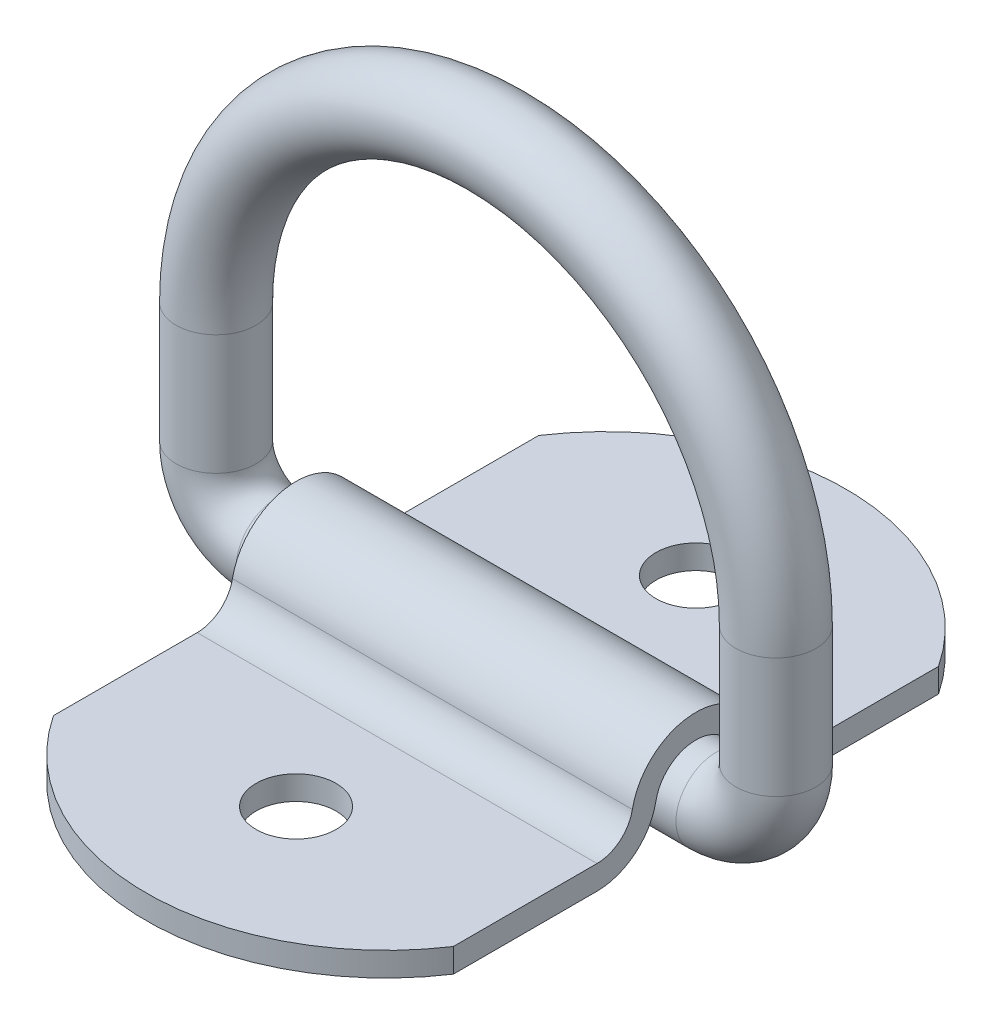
from build123d import *

# Parameters (mm, degrees)
SKETCH2_R           = 3.175
BOSS_EXTRUDE1_DEPTH = 15.875
SKETCH4_R           = 3.175
CUT_EXTRUDE1_DEPTH  = 58.092900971


with BuildPart() as part:
    # Sweep1: sweep along a path in Sketch1
    with BuildLine(Plane.XY) as sweep1_path:
        Line((-22.225, 14.2875), (-22.225, 4.7625))
        ThreePointArc((-22.225, 4.7625), (-20.830096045, 1.394903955), (-17.4625, 0))
        Line((-17.4625, 0), (17.4625, 0))
        ThreePointArc((17.4625, 0), (20.830096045, 1.394903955), (22.225, 4.7625))
        Line((22.225, 4.7625), (22.225, 14.2875))
        ThreePointArc((22.225, 14.2875), (0, 36.5125), (-22.225, 14.2875))
    # Sketch2 → Sweep1 (sweep)
    with BuildSketch(Plane(origin=(0, 0, 0), x_dir=(0, 0, -1), z_dir=(1, 0, 0))):
        Circle(SKETCH2_R)
    sweep(path=sweep1_path.line)


with BuildPart() as body_2:
    # Sketch3 → Boss-Extrude1 (new, symmetric)
    with BuildSketch(Plane(origin=(0, 0, 0), x_dir=(0, 0, -1), z_dir=(1, 0, 0))):
        with BuildLine():
            Line((-27.78125, -3.2385), (-27.78125, -1.3335))
            Line((-27.78125, -1.3335), (-7.854516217, -1.3335))
            ThreePointArc((-7.854516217, -1.3335), (-6.03654897, -0.680609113), (-5.049331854, 0.979714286))
            ThreePointArc((-5.049331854, 0.979714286), (0, 5.1435), (5.049331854, 0.979714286))
            ThreePointArc((5.049331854, 0.979714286), (6.03654897, -0.680609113), (7.854516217, -1.3335))
            Line((7.854516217, -1.3335), (27.78125, -1.3335))
            Line((27.78125, -1.3335), (27.78125, -3.2385))
            Line((27.78125, -3.2385), (7.854516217, -3.2385))
            ThreePointArc((7.854516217, -3.2385), (4.824570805, -2.150348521), (3.179208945, 0.616857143))
            ThreePointArc((3.179208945, 0.616857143), (0, 3.2385), (-3.179208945, 0.616857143))
            ThreePointArc((-3.179208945, 0.616857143), (-4.824570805, -2.150348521), (-7.854516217, -3.2385))
            Line((-7.854516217, -3.2385), (-27.78125, -3.2385))
        make_face()
    extrude(amount=BOSS_EXTRUDE1_DEPTH, both=True)

    # Sketch4 → Cut-Extrude1 (cut, through all)
    with BuildSketch(Plane.XZ.offset(3.2385)):
        with Locations(Location((0, 15.875, 0), (0, 0, 270))):
            Circle(SKETCH4_R)
        with Locations(Location((0, -15.875, 0), (0, 0, 270))):
            Circle(SKETCH4_R)
        with BuildLine():
            Line((-15.875, 19.261533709), (-15.875, 27.78125))
            Line((-15.875, 27.78125), (-15.875, 28.03525))
            Line((-15.875, 28.03525), (15.875, 28.03525))
            Line((15.875, 28.03525), (15.875, 27.78125))
            Line((15.875, 27.78125), (15.875, 19.261533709))
            ThreePointArc((15.875, 19.261533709), (0, 27.78125), (-15.875, 19.261533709))
        make_face()
        with BuildLine():
            Line((15.875, -27.78125), (15.875, -19.261533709))
            ThreePointArc((15.875, -19.261533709), (0, -27.78125), (-15.875, -19.261533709))
            Line((-15.875, -19.261533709), (-15.875, -27.78125))
            Line((-15.875, -27.78125), (-15.875, -28.03525))
            Line((-15.875, -28.03525), (15.875, -28.03525))
            Line((15.875, -28.03525), (15.875, -27.78125))
        make_face()
    extrude(amount=-CUT_EXTRUDE1_DEPTH, mode=Mode.SUBTRACT)


solid = Compound([part.part, body_2.part])
